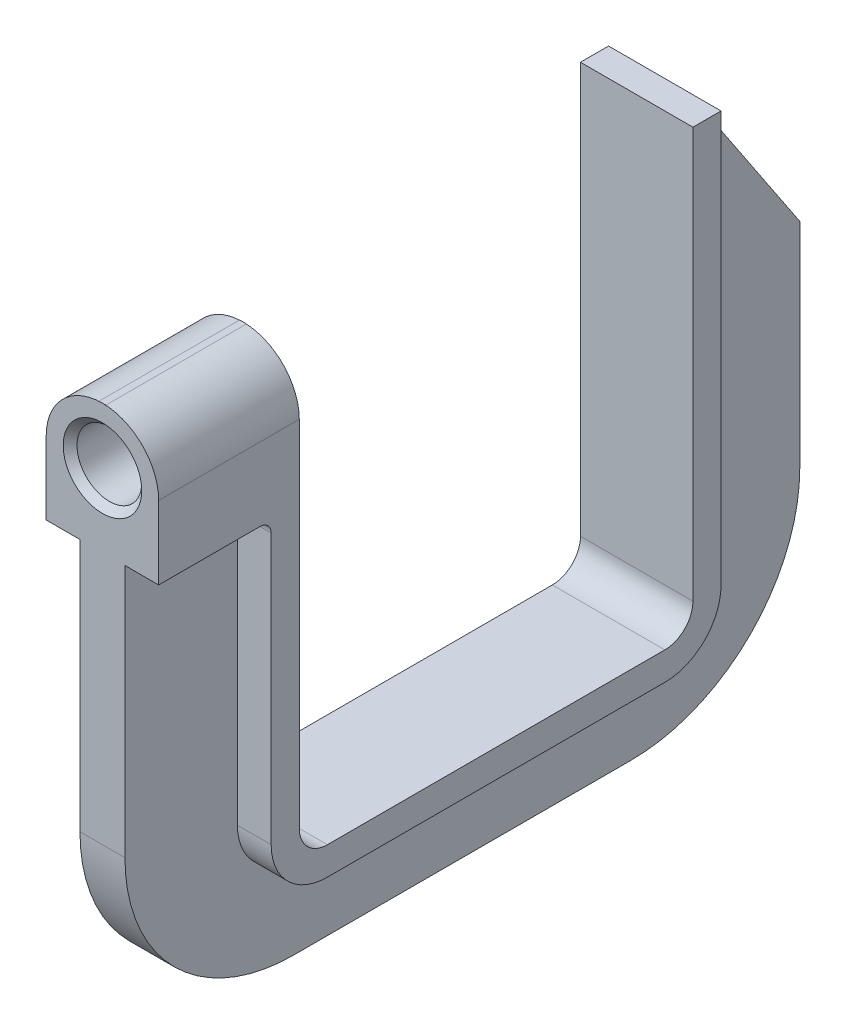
from build123d import *

# Parameters (mm, degrees)
BOSS_EXTRUDE1_DEPTH = 4
BOSS_EXTRUDE2_DEPTH = 10
BOSS_EXTRUDE3_REACH = 157.255
CUT_EXTRUDE2_DEPTH  = 25
FILLET1_R           = 2


with BuildPart() as part:
    # Sketch1 → Boss-Extrude1 (new, symmetric)
    with BuildSketch(Plane(origin=(0, 0, 0), x_dir=(0, 0, -1), z_dir=(1, 0, 0))):
        with BuildLine():
            ThreePointArc((-65, -98), (-86.213203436, -89.213203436), (-95, -68))
            Line((-95, -68), (-95, 0))
            Line((-95, 0), (-75, 0))
            Line((-75, 0), (-75, -73))
            ThreePointArc((-75, -73), (-72.071067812, -80.071067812), (-65, -83))
            Line((-65, -83), (-5, -83))
            ThreePointArc((-5, -83), (2.071067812, -80.071067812), (5, -73))
            Line((5, -73), (5, 0))
            Line((5, 0), (25, -30))
            Line((25, -30), (25, -68))
            ThreePointArc((25, -68), (16.213203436, -89.213203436), (-5, -98))
            Line((-5, -98), (-65, -98))
        make_face()
    extrude(amount=BOSS_EXTRUDE1_DEPTH, both=True)

    # Sketch1_3 → Boss-Extrude2 (add, symmetric)
    with BuildSketch(Plane(origin=(0, 0, 0), x_dir=(0, 0, -1), z_dir=(1, 0, 0))):
        with BuildLine():
            ThreePointArc((-65, -83), (-72.071067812, -80.071067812), (-75, -73))
            Line((-75, -73), (-75, 0))
            Line((-75, 0), (-70, 0))
            Line((-70, 0), (-70, -73))
            ThreePointArc((-70, -73), (-68.535533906, -76.535533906), (-65, -78))
            Line((-65, -78), (-5, -78))
            ThreePointArc((-5, -78), (-1.464466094, -76.535533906), (0, -73))
            Line((0, -73), (0, 0))
            Line((0, 0), (5, 0))
            Line((5, 0), (5, -73))
            ThreePointArc((5, -73), (2.071067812, -80.071067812), (-5, -83))
            Line((-5, -83), (-65, -83))
        make_face()
    extrude(amount=BOSS_EXTRUDE2_DEPTH, both=True)

    # Boss-Extrude3: up to this face of the body (flat: up to its plane)
    boss_extrude3_end = Plane(part.part.faces().sort_by_distance((0, -36.5, 70))[0])
    # Sketch2 → Boss-Extrude3 (add, up to the picked face)
    with BuildSketch(Plane.XY.offset(95), mode=Mode.PRIVATE) as boss_extrude3_sk1:
        with BuildLine():
            Line((-10, -9.981383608), (-10, -23))
            Line((-10, -23), (10, -23))
            Line((10, -23), (10, -9.981383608))
            ThreePointArc((10, -9.981383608), (0, 0.018616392), (-10, -9.981383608))
        make_face()
    boss_extrude3_tool1 = split(extrude(boss_extrude3_sk1.sketch, amount=-BOSS_EXTRUDE3_REACH, mode=Mode.PRIVATE), bisect_by=boss_extrude3_end, keep=Keep.BOTH, mode=Mode.PRIVATE)
    add(boss_extrude3_tool1.solids().sort_by(Axis((0, -12.444367, 95), (0, 0, -1)))[0])

    # Sketch10 → Cut-Extrude2 (cut)
    with BuildSketch(Plane.XY.offset(95)):
        with BuildLine():
            Line((-10, 0), (-10, -9.981383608))
            ThreePointArc((-10, -9.981383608), (-8.366600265, -4.504158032), (-4, -0.816232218))
            Line((-4, -0.816232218), (-4, 0))
            Line((-4, 0), (-10, 0))
        make_face()
        with BuildLine():
            ThreePointArc((4, -0.816232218), (8.366600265, -4.504158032), (10, -9.981383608))
            Line((10, -9.981383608), (10, 0))
            Line((10, 0), (4, 0))
            Line((4, 0), (4, -0.816232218))
        make_face()
        with BuildLine():
            Line((0.609902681, 0), (0, 0))
            ThreePointArc((0, 0), (7.064488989, -2.922352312), (10, -9.981383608))
            ThreePointArc((10, -9.981383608), (8.366600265, -4.504158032), (4, -0.816232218))
            Line((4, -0.816232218), (4, 0))
            Line((4, 0), (0.609902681, 0))
        make_face()
        with BuildLine():
            ThreePointArc((-4, -0.816232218), (-8.366600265, -4.504158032), (-10, -9.981383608))
            ThreePointArc((-10, -9.981383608), (-7.064488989, -2.922352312), (0, 0))
            Line((0, 0), (-0.609902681, 0))
            Line((-0.609902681, 0), (-4, 0))
            Line((-4, 0), (-4, -0.816232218))
        make_face()
    extrude(amount=-CUT_EXTRUDE2_DEPTH, mode=Mode.SUBTRACT)


with BuildPart() as cut_extrude2_piece_1:
    # of the separate pieces the step leaves, piece 1, a body of its own (cut_extrude2_pieces)
    add(part.part.solids().sort_by_distance((-10, -83, 65))[0])

    # Sketch14 → 1_2-20 Tapped Hole2 (revolve, cut)
    with BuildSketch(Plane(origin=(0, -10.000017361, 95), x_dir=(0, -1, 0), z_dir=(1, 0, 0))):
        Polygon((0, 0), (0, 25), (5.75437, 25), (5.75437, 1.23063), (6.985, 0), align=None)
    revolve(axis=Axis((0, -10.000017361, 101.35), (0, 0, -1)), mode=Mode.SUBTRACT)

    # Fillet1
    fillet1_edges = [cut_extrude2_piece_1.edges().sort_by_distance(p)[0] for p in [
        (7, -23, 75),
        (-7, -23, 75),
    ]]
    fillet(fillet1_edges, radius=FILLET1_R)


with BuildPart() as cut_extrude2_piece_2:
    # of the separate pieces the step leaves, piece 2, a body of its own (cut_extrude2_pieces)
    add(part.part.solids().sort_by_distance((0.609902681, 0, 95))[0])


solid = Compound([cut_extrude2_piece_1.part, cut_extrude2_piece_2.part])
